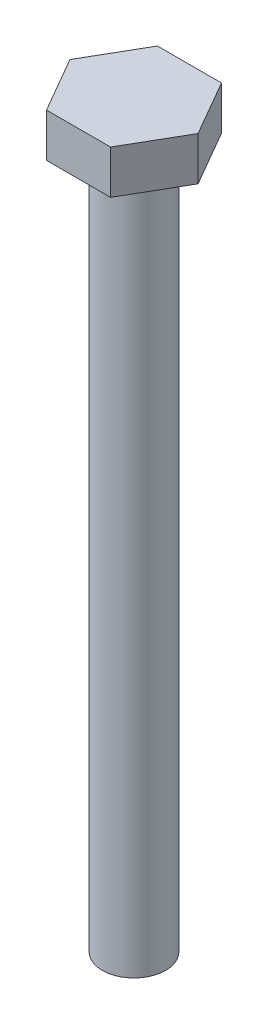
from build123d import *

# Parameters (mm, degrees)
SKETCH1_R           = 3.175
BOSS_EXTRUDE1_DEPTH = 69.85
BOSS_EXTRUDE2_DEPTH = 4.365625


with BuildPart() as part:
    # Sketch1 → Boss-Extrude1 (new body)
    with BuildSketch(Plane(origin=(0, 0, 0), x_dir=(1, 0, 0), z_dir=(0, 1, 0))):
        with Locations(Location((0, 0, 0), (0, 0, 270))):
            Circle(SKETCH1_R)
    extrude(amount=-BOSS_EXTRUDE1_DEPTH)

    # Sketch2 → Boss-Extrude2 (add)
    with BuildSketch(Plane(origin=(0, 0, 0), x_dir=(1, 0, 0), z_dir=(0, 1, 0))):
        Polygon((3.207902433, -5.55625), (6.415804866, 0), (3.207902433, 5.55625), (-3.207902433, 5.55625), (-6.415804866, 0), (-3.207902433, -5.55625), align=None)
    extrude(amount=BOSS_EXTRUDE2_DEPTH)


solid = part.part
